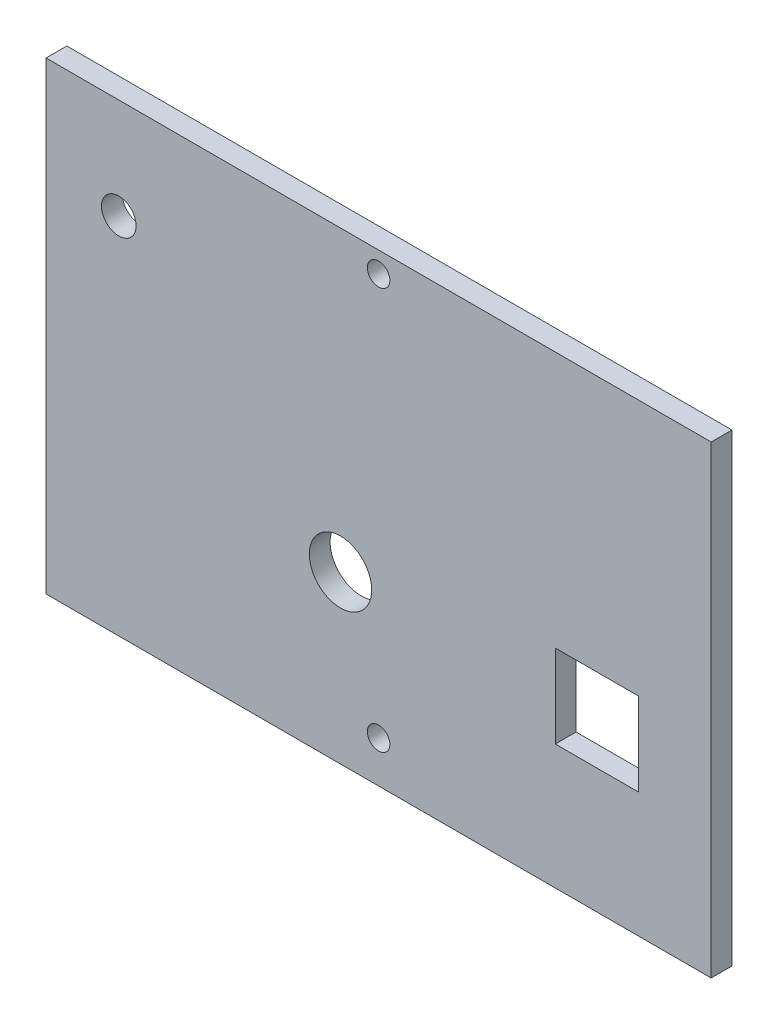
from build123d import *

# Parameters (mm, degrees)
CROQUIS1_W              = 96
CROQUIS1_H              = 67
SALIENTE_EXTRUIR1_DEPTH = 3
CROQUIS2_R              = 2.5
CROQUIS2_R_2            = 4.5
CROQUIS2_R_3            = 1.625
CROQUIS2_W              = 12
CROQUIS2_H              = 12
CORTAR_EXTRUIR1_DEPTH   = 59.611005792


with BuildPart() as part:
    # Croquis1 → Saliente-Extruir1 (new body)
    with BuildSketch(Plane.XY):
        Rectangle(CROQUIS1_W, CROQUIS1_H)
    extrude(amount=SALIENTE_EXTRUIR1_DEPTH)

    # Croquis2 → Cortar-Extruir1 (cut, through all)
    with BuildSketch(Plane.XY):
        with Locations((-37.5, 19)):
            Circle(CROQUIS2_R)
        with Locations((-5.5, -9.5)):
            Circle(CROQUIS2_R_2)
        with Locations((0, 30.5)):
            Circle(CROQUIS2_R_3)
        with Locations((0, -27.5)):
            Circle(CROQUIS2_R_3)
        with Locations((31.5, -9.5)):
            Rectangle(CROQUIS2_W, CROQUIS2_H)
    extrude(amount=CORTAR_EXTRUIR1_DEPTH, mode=Mode.SUBTRACT)


solid = part.part
